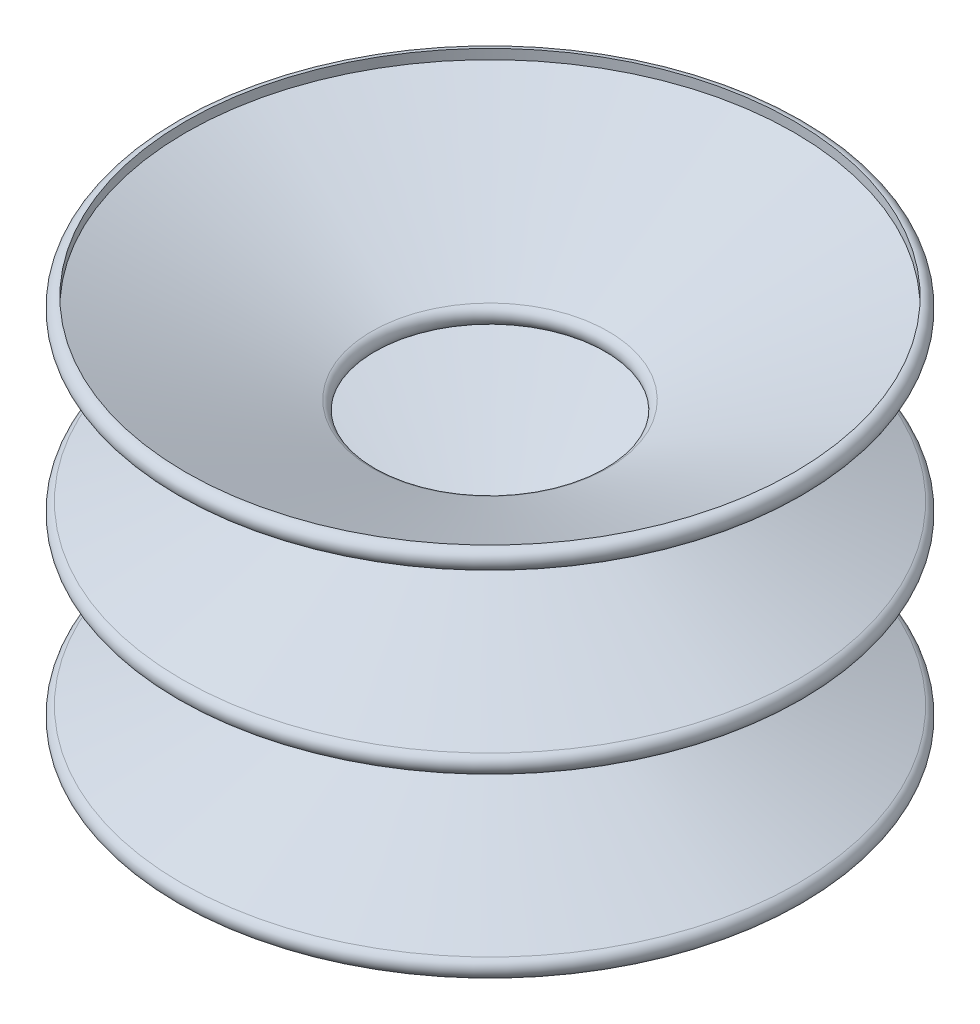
ISO-10303-21;
HEADER;
FILE_DESCRIPTION(('STEP AP214'),'2;1');
FILE_NAME('part.step','',(''),(''),'','','');
FILE_SCHEMA(('AUTOMOTIVE_DESIGN { 1 0 10303 214 1 1 1 1 }'));
ENDSEC;
DATA;
#1=APPLICATION_CONTEXT('core data for automotive mechanical design processes');
#2=APPLICATION_PROTOCOL_DEFINITION('international standard','automotive_design',2000,#1);
#3=PRODUCT_CONTEXT('',#1,'mechanical');
#4=PRODUCT('Part','Part','',(#3));
#5=PRODUCT_RELATED_PRODUCT_CATEGORY('part','',(#4));
#6=PRODUCT_DEFINITION_FORMATION('','',#4);
#7=PRODUCT_DEFINITION_CONTEXT('part definition',#1,'design');
#8=PRODUCT_DEFINITION('design','',#6,#7);
#9=PRODUCT_DEFINITION_SHAPE('','',#8);
#10=(LENGTH_UNIT() NAMED_UNIT(*) SI_UNIT(.MILLI.,.METRE.));
#11=(NAMED_UNIT(*) PLANE_ANGLE_UNIT() SI_UNIT($,.RADIAN.));
#12=(NAMED_UNIT(*) SI_UNIT($,.STERADIAN.) SOLID_ANGLE_UNIT());
#13=UNCERTAINTY_MEASURE_WITH_UNIT(LENGTH_MEASURE(1.E-05),#10,'distance_accuracy_value','');
#14=(GEOMETRIC_REPRESENTATION_CONTEXT(3) GLOBAL_UNCERTAINTY_ASSIGNED_CONTEXT((#13)) GLOBAL_UNIT_ASSIGNED_CONTEXT((#10,
#11,#12)) REPRESENTATION_CONTEXT('',''));
#15=CARTESIAN_POINT('',(0.,0.,0.));
#16=DIRECTION('',(0.,0.,1.));
#17=DIRECTION('',(1.,0.,0.));
#18=AXIS2_PLACEMENT_3D('',#15,#16,#17);
#19=CARTESIAN_POINT('',(0.,90.8709851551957,0.));
#20=DIRECTION('',(0.,1.,0.));
#21=DIRECTION('',(0.,0.,1.));
#22=AXIS2_PLACEMENT_3D('',#19,#20,#21);
#23=CYLINDRICAL_SURFACE('',#22,4.99999999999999);
#24=CARTESIAN_POINT('',(0.,1.,0.));
#25=DIRECTION('',(0.,1.,0.));
#26=DIRECTION('',(0.,0.,1.));
#27=AXIS2_PLACEMENT_3D('',#24,#25,#26);
#28=CIRCLE('',#27,4.99999999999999);
#29=CARTESIAN_POINT('',(0.,1.,4.99999999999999));
#30=VERTEX_POINT('',#29);
#31=EDGE_CURVE('E10',#30,#30,#28,.T.);
#32=ORIENTED_EDGE('',*,*,#31,.T.);
#33=EDGE_LOOP('',(#32));
#34=FACE_BOUND('',#33,.T.);
#35=CARTESIAN_POINT('',(0.,0.,0.));
#36=DIRECTION('',(0.,1.,0.));
#37=DIRECTION('',(0.,0.,1.));
#38=AXIS2_PLACEMENT_3D('',#35,#36,#37);
#39=CIRCLE('',#38,4.99999999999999);
#40=CARTESIAN_POINT('',(0.,0.,4.99999999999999));
#41=VERTEX_POINT('',#40);
#42=EDGE_CURVE('E97',#41,#41,#39,.T.);
#43=ORIENTED_EDGE('',*,*,#42,.F.);
#44=EDGE_LOOP('',(#43));
#45=FACE_BOUND('',#44,.T.);
#46=ADVANCED_FACE('F24',(#34,#45),#23,.F.);
#47=CARTESIAN_POINT('',(-8.99999999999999,1.,0.));
#48=DIRECTION('',(0.,1.,0.));
#49=DIRECTION('',(0.,0.,1.));
#50=AXIS2_PLACEMENT_3D('',#47,#48,#49);
#51=PLANE('',#50);
#52=CARTESIAN_POINT('',(0.,1.,0.));
#53=DIRECTION('',(0.,1.,0.));
#54=DIRECTION('',(0.,0.,1.));
#55=AXIS2_PLACEMENT_3D('',#52,#53,#54);
#56=CIRCLE('',#55,8.99999999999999);
#57=CARTESIAN_POINT('',(0.,1.,8.99999999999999));
#58=VERTEX_POINT('',#57);
#59=EDGE_CURVE('E30',#58,#58,#56,.T.);
#60=ORIENTED_EDGE('',*,*,#59,.T.);
#61=EDGE_LOOP('',(#60));
#62=FACE_BOUND('',#61,.T.);
#63=ORIENTED_EDGE('',*,*,#31,.F.);
#64=EDGE_LOOP('',(#63));
#65=FACE_BOUND('',#64,.T.);
#66=ADVANCED_FACE('F105',(#62,#65),#51,.T.);
#67=CARTESIAN_POINT('',(0.,90.8709851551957,0.));
#68=DIRECTION('',(0.,1.,0.));
#69=DIRECTION('',(0.,0.,1.));
#70=AXIS2_PLACEMENT_3D('',#67,#68,#69);
#71=CYLINDRICAL_SURFACE('',#70,8.99999999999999);
#72=CARTESIAN_POINT('',(0.,4.69,0.));
#73=DIRECTION('',(0.,1.,0.));
#74=DIRECTION('',(0.,0.,1.));
#75=AXIS2_PLACEMENT_3D('',#72,#73,#74);
#76=CIRCLE('',#75,8.99999999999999);
#77=CARTESIAN_POINT('',(0.,4.69,8.99999999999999));
#78=VERTEX_POINT('',#77);
#79=EDGE_CURVE('E34',#78,#78,#76,.T.);
#80=ORIENTED_EDGE('',*,*,#79,.T.);
#81=EDGE_LOOP('',(#80));
#82=FACE_BOUND('',#81,.T.);
#83=ORIENTED_EDGE('',*,*,#59,.F.);
#84=EDGE_LOOP('',(#83));
#85=FACE_BOUND('',#84,.T.);
#86=ADVANCED_FACE('F109',(#82,#85),#71,.F.);
#87=CARTESIAN_POINT('',(0.,4.69,0.));
#88=DIRECTION('',(0.,1.,0.));
#89=DIRECTION('',(0.,0.,1.));
#90=AXIS2_PLACEMENT_3D('',#87,#88,#89);
#91=CONICAL_SURFACE('',#90,8.99999999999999,1.20963676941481);
#92=CARTESIAN_POINT('',(0.,13.,0.));
#93=DIRECTION('',(0.,1.,0.));
#94=DIRECTION('',(0.,0.,1.));
#95=AXIS2_PLACEMENT_3D('',#92,#93,#94);
#96=CIRCLE('',#95,31.);
#97=CARTESIAN_POINT('',(0.,13.,31.));
#98=VERTEX_POINT('',#97);
#99=EDGE_CURVE('E38',#98,#98,#96,.T.);
#100=CARTESIAN_POINT('',(0.,13.,31.));
#101=CARTESIAN_POINT('',(0.,12.9134375,30.7708333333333));
#102=CARTESIAN_POINT('',(0.,12.826875,30.5416666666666));
#103=CARTESIAN_POINT('',(0.,12.65375,30.0833333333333));
#104=CARTESIAN_POINT('',(0.,12.5671875,29.8541666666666));
#105=CARTESIAN_POINT('',(0.,12.3940625,29.3958333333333));
#106=CARTESIAN_POINT('',(0.,12.3075,29.1666666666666));
#107=CARTESIAN_POINT('',(0.,12.134375,28.7083333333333));
#108=CARTESIAN_POINT('',(0.,12.0478125,28.4791666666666));
#109=CARTESIAN_POINT('',(0.,11.8746875,28.0208333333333));
#110=CARTESIAN_POINT('',(0.,11.788125,27.7916666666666));
#111=CARTESIAN_POINT('',(0.,11.615,27.3333333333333));
#112=CARTESIAN_POINT('',(0.,11.5284375,27.1041666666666));
#113=CARTESIAN_POINT('',(0.,11.3553125,26.6458333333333));
#114=CARTESIAN_POINT('',(0.,11.26875,26.4166666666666));
#115=CARTESIAN_POINT('',(0.,11.095625,25.9583333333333));
#116=CARTESIAN_POINT('',(0.,11.0090625,25.7291666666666));
#117=CARTESIAN_POINT('',(0.,10.8359375,25.2708333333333));
#118=CARTESIAN_POINT('',(0.,10.749375,25.0416666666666));
#119=CARTESIAN_POINT('',(0.,10.57625,24.5833333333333));
#120=CARTESIAN_POINT('',(0.,10.4896875,24.3541666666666));
#121=CARTESIAN_POINT('',(0.,10.3165625,23.8958333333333));
#122=CARTESIAN_POINT('',(0.,10.23,23.6666666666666));
#123=CARTESIAN_POINT('',(0.,10.056875,23.2083333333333));
#124=CARTESIAN_POINT('',(0.,9.9703125,22.9791666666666));
#125=CARTESIAN_POINT('',(0.,9.7971875,22.5208333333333));
#126=CARTESIAN_POINT('',(0.,9.710625,22.2916666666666));
#127=CARTESIAN_POINT('',(0.,9.5375,21.8333333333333));
#128=CARTESIAN_POINT('',(0.,9.4509375,21.6041666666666));
#129=CARTESIAN_POINT('',(0.,9.2778125,21.1458333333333));
#130=CARTESIAN_POINT('',(0.,9.19125,20.9166666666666));
#131=CARTESIAN_POINT('',(0.,9.018125,20.4583333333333));
#132=CARTESIAN_POINT('',(0.,8.9315625,20.2291666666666));
#133=CARTESIAN_POINT('',(0.,8.7584375,19.7708333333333));
#134=CARTESIAN_POINT('',(0.,8.671875,19.5416666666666));
#135=CARTESIAN_POINT('',(0.,8.49875,19.0833333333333));
#136=CARTESIAN_POINT('',(0.,8.4121875,18.8541666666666));
#137=CARTESIAN_POINT('',(0.,8.2390625,18.3958333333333));
#138=CARTESIAN_POINT('',(0.,8.1525,18.1666666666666));
#139=CARTESIAN_POINT('',(0.,7.979375,17.7083333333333));
#140=CARTESIAN_POINT('',(0.,7.8928125,17.4791666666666));
#141=CARTESIAN_POINT('',(0.,7.7196875,17.0208333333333));
#142=CARTESIAN_POINT('',(0.,7.633125,16.7916666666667));
#143=CARTESIAN_POINT('',(0.,7.46,16.3333333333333));
#144=CARTESIAN_POINT('',(0.,7.3734375,16.1041666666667));
#145=CARTESIAN_POINT('',(0.,7.2003125,15.6458333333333));
#146=CARTESIAN_POINT('',(0.,7.11375,15.4166666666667));
#147=CARTESIAN_POINT('',(0.,6.940625,14.9583333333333));
#148=CARTESIAN_POINT('',(0.,6.8540625,14.7291666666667));
#149=CARTESIAN_POINT('',(0.,6.6809375,14.2708333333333));
#150=CARTESIAN_POINT('',(0.,6.594375,14.0416666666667));
#151=CARTESIAN_POINT('',(0.,6.42125,13.5833333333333));
#152=CARTESIAN_POINT('',(0.,6.3346875,13.3541666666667));
#153=CARTESIAN_POINT('',(0.,6.1615625,12.8958333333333));
#154=CARTESIAN_POINT('',(0.,6.075,12.6666666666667));
#155=CARTESIAN_POINT('',(0.,5.901875,12.2083333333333));
#156=CARTESIAN_POINT('',(0.,5.8153125,11.9791666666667));
#157=CARTESIAN_POINT('',(0.,5.6421875,11.5208333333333));
#158=CARTESIAN_POINT('',(0.,5.555625,11.2916666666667));
#159=CARTESIAN_POINT('',(0.,5.3825,10.8333333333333));
#160=CARTESIAN_POINT('',(0.,5.2959375,10.6041666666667));
#161=CARTESIAN_POINT('',(0.,5.1228125,10.1458333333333));
#162=CARTESIAN_POINT('',(0.,5.03625,9.91666666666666));
#163=CARTESIAN_POINT('',(0.,4.863125,9.45833333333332));
#164=CARTESIAN_POINT('',(0.,4.7765625,9.22916666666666));
#165=CARTESIAN_POINT('',(0.,4.69,8.99999999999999));
#166=B_SPLINE_CURVE_WITH_KNOTS('',3,(#100,#101,#102,#103,#104,#105,#106,#107,#108,#109,#110,
#111,#112,#113,#114,#115,#116,#117,#118,#119,#120,#121,#122,#123,#124,#125,#126,#127,#128,#129,
#130,#131,#132,#133,#134,#135,#136,#137,#138,#139,#140,#141,#142,#143,#144,#145,#146,#147,#148,
#149,#150,#151,#152,#153,#154,#155,#156,#157,#158,#159,#160,#161,#162,#163,#164,#165),
.UNSPECIFIED.,.F.,.F.,(4,2,2,2,2,2,2,2,2,2,2,2,2,2,2,2,2,2,2,2,2,2,2,2,2,2,2,2,2,2,2,2,4),(0.,
0.73491077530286,1.46982155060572,2.20473232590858,2.93964310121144,3.67455387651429,
4.40946465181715,5.14437542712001,5.87928620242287,6.61419697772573,7.34910775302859,
8.08401852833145,8.81892930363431,9.55384007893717,10.28875085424,11.0236616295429,
11.7585724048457,12.4934831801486,13.2283939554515,13.9633047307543,14.6982155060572,
15.43312628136,16.1680370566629,16.9029478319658,17.6378586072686,18.3727693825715,
19.1076801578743,19.8425909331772,20.5775017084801,21.3124124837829,22.0473232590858,
22.7822340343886,23.5171448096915),.UNSPECIFIED.);
#167=EDGE_CURVE('BSEAM113',#98,#78,#166,.T.);
#168=ORIENTED_EDGE('',*,*,#99,.T.);
#169=ORIENTED_EDGE('',*,*,#79,.F.);
#170=ORIENTED_EDGE('',*,*,#167,.T.);
#171=ORIENTED_EDGE('',*,*,#167,.F.);
#172=EDGE_LOOP('',(#168,#170,#169,#171));
#173=FACE_BOUND('',#172,.T.);
#174=ADVANCED_FACE('F113',(#173),#91,.F.);
#175=CARTESIAN_POINT('',(0.,13.,0.));
#176=DIRECTION('',(0.,-1.,0.));
#177=DIRECTION('',(0.,0.,-1.));
#178=AXIS2_PLACEMENT_3D('',#175,#176,#177);
#179=CONICAL_SURFACE('',#178,31.,1.16759904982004);
#180=CARTESIAN_POINT('',(0.,21.0801887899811,0.));
#181=DIRECTION('',(0.,1.,0.));
#182=DIRECTION('',(0.,0.,1.));
#183=AXIS2_PLACEMENT_3D('',#180,#181,#182);
#184=CIRCLE('',#183,12.0576387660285);
#185=CARTESIAN_POINT('',(0.,21.0801887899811,12.0576387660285));
#186=VERTEX_POINT('',#185);
#187=EDGE_CURVE('E43',#186,#186,#184,.T.);
#188=ORIENTED_EDGE('',*,*,#187,.T.);
#189=EDGE_LOOP('',(#188));
#190=FACE_BOUND('',#189,.T.);
#191=ORIENTED_EDGE('',*,*,#99,.F.);
#192=EDGE_LOOP('',(#191));
#193=FACE_BOUND('',#192,.T.);
#194=ADVANCED_FACE('F120',(#190,#193),#179,.F.);
#195=CARTESIAN_POINT('',(0.,22.,0.));
#196=DIRECTION('',(0.,1.,0.));
#197=DIRECTION('',(0.,0.,1.));
#198=AXIS2_PLACEMENT_3D('',#195,#196,#197);
#199=TOROIDAL_SURFACE('',#198,12.45,0.999999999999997);
#200=CARTESIAN_POINT('',(0.,22.9198112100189,0.));
#201=DIRECTION('',(0.,1.,0.));
#202=DIRECTION('',(0.,0.,1.));
#203=AXIS2_PLACEMENT_3D('',#200,#201,#202);
#204=CIRCLE('',#203,12.0576387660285);
#205=CARTESIAN_POINT('',(0.,22.9198112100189,12.0576387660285));
#206=VERTEX_POINT('',#205);
#207=EDGE_CURVE('E46',#206,#206,#204,.T.);
#208=ORIENTED_EDGE('',*,*,#207,.T.);
#209=EDGE_LOOP('',(#208));
#210=FACE_BOUND('',#209,.T.);
#211=ORIENTED_EDGE('',*,*,#187,.F.);
#212=EDGE_LOOP('',(#211));
#213=FACE_BOUND('',#212,.T.);
#214=ADVANCED_FACE('F124',(#210,#213),#199,.T.);
#215=CARTESIAN_POINT('',(0.,22.9198112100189,0.));
#216=DIRECTION('',(0.,1.,0.));
#217=DIRECTION('',(0.,0.,1.));
#218=AXIS2_PLACEMENT_3D('',#215,#216,#217);
#219=CONICAL_SURFACE('',#218,12.0576387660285,1.16759904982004);
#220=CARTESIAN_POINT('',(0.,31.,0.));
#221=DIRECTION('',(0.,1.,0.));
#222=DIRECTION('',(0.,0.,1.));
#223=AXIS2_PLACEMENT_3D('',#220,#221,#222);
#224=CIRCLE('',#223,31.);
#225=CARTESIAN_POINT('',(0.,31.,31.));
#226=VERTEX_POINT('',#225);
#227=EDGE_CURVE('E49',#226,#226,#224,.T.);
#228=ORIENTED_EDGE('',*,*,#227,.T.);
#229=EDGE_LOOP('',(#228));
#230=FACE_BOUND('',#229,.T.);
#231=ORIENTED_EDGE('',*,*,#207,.F.);
#232=EDGE_LOOP('',(#231));
#233=FACE_BOUND('',#232,.T.);
#234=ADVANCED_FACE('F128',(#230,#233),#219,.F.);
#235=CARTESIAN_POINT('',(0.,31.,0.));
#236=DIRECTION('',(0.,-1.,0.));
#237=DIRECTION('',(0.,0.,-1.));
#238=AXIS2_PLACEMENT_3D('',#235,#236,#237);
#239=CONICAL_SURFACE('',#238,31.,1.16759904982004);
#240=CARTESIAN_POINT('',(0.,39.0801887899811,0.));
#241=DIRECTION('',(0.,1.,0.));
#242=DIRECTION('',(0.,0.,1.));
#243=AXIS2_PLACEMENT_3D('',#240,#241,#242);
#244=CIRCLE('',#243,12.0576387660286);
#245=CARTESIAN_POINT('',(0.,39.0801887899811,12.0576387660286));
#246=VERTEX_POINT('',#245);
#247=EDGE_CURVE('E52',#246,#246,#244,.T.);
#248=ORIENTED_EDGE('',*,*,#247,.T.);
#249=EDGE_LOOP('',(#248));
#250=FACE_BOUND('',#249,.T.);
#251=ORIENTED_EDGE('',*,*,#227,.F.);
#252=EDGE_LOOP('',(#251));
#253=FACE_BOUND('',#252,.T.);
#254=ADVANCED_FACE('F132',(#250,#253),#239,.F.);
#255=CARTESIAN_POINT('',(0.,40.,0.));
#256=DIRECTION('',(0.,1.,0.));
#257=DIRECTION('',(0.,0.,1.));
#258=AXIS2_PLACEMENT_3D('',#255,#256,#257);
#259=TOROIDAL_SURFACE('',#258,12.45,1.00000000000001);
#260=CARTESIAN_POINT('',(0.,40.9198112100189,0.));
#261=DIRECTION('',(0.,1.,0.));
#262=DIRECTION('',(0.,0.,1.));
#263=AXIS2_PLACEMENT_3D('',#260,#261,#262);
#264=CIRCLE('',#263,12.0576387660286);
#265=CARTESIAN_POINT('',(0.,40.9198112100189,12.0576387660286));
#266=VERTEX_POINT('',#265);
#267=EDGE_CURVE('E55',#266,#266,#264,.T.);
#268=ORIENTED_EDGE('',*,*,#267,.T.);
#269=EDGE_LOOP('',(#268));
#270=FACE_BOUND('',#269,.T.);
#271=ORIENTED_EDGE('',*,*,#247,.F.);
#272=EDGE_LOOP('',(#271));
#273=FACE_BOUND('',#272,.T.);
#274=ADVANCED_FACE('F136',(#270,#273),#259,.T.);
#275=CARTESIAN_POINT('',(0.,40.9198112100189,0.));
#276=DIRECTION('',(0.,1.,0.));
#277=DIRECTION('',(0.,0.,1.));
#278=AXIS2_PLACEMENT_3D('',#275,#276,#277);
#279=CONICAL_SURFACE('',#278,12.0576387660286,1.16759904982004);
#280=CARTESIAN_POINT('',(0.,49.,0.));
#281=DIRECTION('',(0.,1.,0.));
#282=DIRECTION('',(0.,0.,1.));
#283=AXIS2_PLACEMENT_3D('',#280,#281,#282);
#284=CIRCLE('',#283,31.);
#285=CARTESIAN_POINT('',(0.,49.,31.));
#286=VERTEX_POINT('',#285);
#287=EDGE_CURVE('E58',#286,#286,#284,.T.);
#288=ORIENTED_EDGE('',*,*,#287,.T.);
#289=EDGE_LOOP('',(#288));
#290=FACE_BOUND('',#289,.T.);
#291=ORIENTED_EDGE('',*,*,#267,.F.);
#292=EDGE_LOOP('',(#291));
#293=FACE_BOUND('',#292,.T.);
#294=ADVANCED_FACE('F140',(#290,#293),#279,.F.);
#295=CARTESIAN_POINT('',(0.,90.8709851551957,0.));
#296=DIRECTION('',(0.,1.,0.));
#297=DIRECTION('',(0.,0.,1.));
#298=AXIS2_PLACEMENT_3D('',#295,#296,#297);
#299=CYLINDRICAL_SURFACE('',#298,31.);
#300=CARTESIAN_POINT('',(0.,50.,0.));
#301=DIRECTION('',(0.,1.,0.));
#302=DIRECTION('',(0.,0.,1.));
#303=AXIS2_PLACEMENT_3D('',#300,#301,#302);
#304=CIRCLE('',#303,31.);
#305=CARTESIAN_POINT('',(0.,50.,31.));
#306=VERTEX_POINT('',#305);
#307=EDGE_CURVE('E61',#306,#306,#304,.T.);
#308=ORIENTED_EDGE('',*,*,#307,.T.);
#309=EDGE_LOOP('',(#308));
#310=FACE_BOUND('',#309,.T.);
#311=ORIENTED_EDGE('',*,*,#287,.F.);
#312=EDGE_LOOP('',(#311));
#313=FACE_BOUND('',#312,.T.);
#314=ADVANCED_FACE('F144',(#310,#313),#299,.F.);
#315=CARTESIAN_POINT('',(0.,49.,0.));
#316=DIRECTION('',(0.,1.,0.));
#317=DIRECTION('',(0.,0.,1.));
#318=AXIS2_PLACEMENT_3D('',#315,#316,#317);
#319=TOROIDAL_SURFACE('',#318,31.,0.999999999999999);
#320=CARTESIAN_POINT('',(0.,48.0801999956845,0.));
#321=DIRECTION('',(0.,1.,0.));
#322=DIRECTION('',(0.,0.,1.));
#323=AXIS2_PLACEMENT_3D('',#320,#321,#322);
#324=CIRCLE('',#323,31.3923875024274);
#325=CARTESIAN_POINT('',(0.,48.0801999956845,31.3923875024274));
#326=VERTEX_POINT('',#325);
#327=EDGE_CURVE('E64',#326,#326,#324,.T.);
#328=ORIENTED_EDGE('',*,*,#327,.T.);
#329=EDGE_LOOP('',(#328));
#330=FACE_BOUND('',#329,.T.);
#331=ORIENTED_EDGE('',*,*,#307,.F.);
#332=EDGE_LOOP('',(#331));
#333=FACE_BOUND('',#332,.T.);
#334=ADVANCED_FACE('F148',(#330,#333),#319,.T.);
#335=CARTESIAN_POINT('',(0.,48.0801999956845,0.));
#336=DIRECTION('',(0.,1.,0.));
#337=DIRECTION('',(0.,0.,1.));
#338=AXIS2_PLACEMENT_3D('',#335,#336,#337);
#339=CONICAL_SURFACE('',#338,31.3923875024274,1.1675704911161);
#340=CARTESIAN_POINT('',(0.,40.9198000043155,0.));
#341=DIRECTION('',(0.,1.,0.));
#342=DIRECTION('',(0.,0.,1.));
#343=AXIS2_PLACEMENT_3D('',#340,#341,#342);
#344=CIRCLE('',#343,14.6076124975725);
#345=CARTESIAN_POINT('',(0.,40.9198000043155,14.6076124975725));
#346=VERTEX_POINT('',#345);
#347=EDGE_CURVE('E67',#346,#346,#344,.T.);
#348=ORIENTED_EDGE('',*,*,#347,.T.);
#349=EDGE_LOOP('',(#348));
#350=FACE_BOUND('',#349,.T.);
#351=ORIENTED_EDGE('',*,*,#327,.F.);
#352=EDGE_LOOP('',(#351));
#353=FACE_BOUND('',#352,.T.);
#354=ADVANCED_FACE('F152',(#350,#353),#339,.T.);
#355=CARTESIAN_POINT('',(0.,40.,0.));
#356=DIRECTION('',(0.,1.,0.));
#357=DIRECTION('',(0.,0.,1.));
#358=AXIS2_PLACEMENT_3D('',#355,#356,#357);
#359=TOROIDAL_SURFACE('',#358,15.,1.);
#360=CARTESIAN_POINT('',(0.,39.0801999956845,0.));
#361=DIRECTION('',(0.,1.,0.));
#362=DIRECTION('',(0.,0.,1.));
#363=AXIS2_PLACEMENT_3D('',#360,#361,#362);
#364=CIRCLE('',#363,14.6076124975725);
#365=CARTESIAN_POINT('',(0.,39.0801999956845,14.6076124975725));
#366=VERTEX_POINT('',#365);
#367=EDGE_CURVE('E70',#366,#366,#364,.T.);
#368=ORIENTED_EDGE('',*,*,#367,.T.);
#369=EDGE_LOOP('',(#368));
#370=FACE_BOUND('',#369,.T.);
#371=ORIENTED_EDGE('',*,*,#347,.F.);
#372=EDGE_LOOP('',(#371));
#373=FACE_BOUND('',#372,.T.);
#374=ADVANCED_FACE('F156',(#370,#373),#359,.F.);
#375=CARTESIAN_POINT('',(0.,39.0801999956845,0.));
#376=DIRECTION('',(0.,-1.,0.));
#377=DIRECTION('',(0.,0.,-1.));
#378=AXIS2_PLACEMENT_3D('',#375,#376,#377);
#379=CONICAL_SURFACE('',#378,14.6076124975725,1.1675704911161);
#380=CARTESIAN_POINT('',(0.,31.9198000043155,0.));
#381=DIRECTION('',(0.,1.,0.));
#382=DIRECTION('',(0.,0.,1.));
#383=AXIS2_PLACEMENT_3D('',#380,#381,#382);
#384=CIRCLE('',#383,31.3923875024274);
#385=CARTESIAN_POINT('',(0.,31.9198000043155,31.3923875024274));
#386=VERTEX_POINT('',#385);
#387=EDGE_CURVE('E73',#386,#386,#384,.T.);
#388=ORIENTED_EDGE('',*,*,#387,.T.);
#389=EDGE_LOOP('',(#388));
#390=FACE_BOUND('',#389,.T.);
#391=ORIENTED_EDGE('',*,*,#367,.F.);
#392=EDGE_LOOP('',(#391));
#393=FACE_BOUND('',#392,.T.);
#394=ADVANCED_FACE('F160',(#390,#393),#379,.T.);
#395=CARTESIAN_POINT('',(0.,31.,0.));
#396=DIRECTION('',(0.,1.,0.));
#397=DIRECTION('',(0.,0.,1.));
#398=AXIS2_PLACEMENT_3D('',#395,#396,#397);
#399=TOROIDAL_SURFACE('',#398,31.,1.);
#400=CARTESIAN_POINT('',(0.,30.0801887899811,0.));
#401=DIRECTION('',(0.,1.,0.));
#402=DIRECTION('',(0.,0.,1.));
#403=AXIS2_PLACEMENT_3D('',#400,#401,#402);
#404=CIRCLE('',#403,31.3923612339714);
#405=CARTESIAN_POINT('',(0.,30.0801887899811,31.3923612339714));
#406=VERTEX_POINT('',#405);
#407=EDGE_CURVE('E76',#406,#406,#404,.T.);
#408=ORIENTED_EDGE('',*,*,#407,.T.);
#409=EDGE_LOOP('',(#408));
#410=FACE_BOUND('',#409,.T.);
#411=ORIENTED_EDGE('',*,*,#387,.F.);
#412=EDGE_LOOP('',(#411));
#413=FACE_BOUND('',#412,.T.);
#414=ADVANCED_FACE('F164',(#410,#413),#399,.T.);
#415=CARTESIAN_POINT('',(0.,30.0801887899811,0.));
#416=DIRECTION('',(0.,1.,0.));
#417=DIRECTION('',(0.,0.,1.));
#418=AXIS2_PLACEMENT_3D('',#415,#416,#417);
#419=CONICAL_SURFACE('',#418,31.3923612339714,1.16759904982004);
#420=CARTESIAN_POINT('',(0.,22.9202905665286,0.));
#421=DIRECTION('',(0.,1.,0.));
#422=DIRECTION('',(0.,0.,1.));
#423=AXIS2_PLACEMENT_3D('',#420,#421,#422);
#424=CIRCLE('',#423,14.6074342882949);
#425=CARTESIAN_POINT('',(0.,22.9202905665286,14.6074342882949));
#426=VERTEX_POINT('',#425);
#427=EDGE_CURVE('E79',#426,#426,#424,.T.);
#428=ORIENTED_EDGE('',*,*,#427,.T.);
#429=EDGE_LOOP('',(#428));
#430=FACE_BOUND('',#429,.T.);
#431=ORIENTED_EDGE('',*,*,#407,.F.);
#432=EDGE_LOOP('',(#431));
#433=FACE_BOUND('',#432,.T.);
#434=ADVANCED_FACE('F168',(#430,#433),#419,.T.);
#435=CARTESIAN_POINT('',(0.,22.,0.));
#436=DIRECTION('',(0.,1.,0.));
#437=DIRECTION('',(0.,0.,1.));
#438=AXIS2_PLACEMENT_3D('',#435,#436,#437);
#439=TOROIDAL_SURFACE('',#438,15.,1.00052114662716);
#440=CARTESIAN_POINT('',(0.,21.0797094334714,0.));
#441=DIRECTION('',(0.,1.,0.));
#442=DIRECTION('',(0.,0.,1.));
#443=AXIS2_PLACEMENT_3D('',#440,#441,#442);
#444=CIRCLE('',#443,14.6074342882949);
#445=CARTESIAN_POINT('',(0.,21.0797094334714,14.6074342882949));
#446=VERTEX_POINT('',#445);
#447=EDGE_CURVE('E82',#446,#446,#444,.T.);
#448=ORIENTED_EDGE('',*,*,#447,.T.);
#449=EDGE_LOOP('',(#448));
#450=FACE_BOUND('',#449,.T.);
#451=ORIENTED_EDGE('',*,*,#427,.F.);
#452=EDGE_LOOP('',(#451));
#453=FACE_BOUND('',#452,.T.);
#454=ADVANCED_FACE('F172',(#450,#453),#439,.F.);
#455=CARTESIAN_POINT('',(0.,21.0797094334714,0.));
#456=DIRECTION('',(0.,-1.,0.));
#457=DIRECTION('',(0.,0.,-1.));
#458=AXIS2_PLACEMENT_3D('',#455,#456,#457);
#459=CONICAL_SURFACE('',#458,14.6074342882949,1.16759904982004);
#460=CARTESIAN_POINT('',(0.,13.9198112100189,0.));
#461=DIRECTION('',(0.,1.,0.));
#462=DIRECTION('',(0.,0.,1.));
#463=AXIS2_PLACEMENT_3D('',#460,#461,#462);
#464=CIRCLE('',#463,31.3923612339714);
#465=CARTESIAN_POINT('',(0.,13.9198112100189,31.3923612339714));
#466=VERTEX_POINT('',#465);
#467=EDGE_CURVE('E85',#466,#466,#464,.T.);
#468=ORIENTED_EDGE('',*,*,#467,.T.);
#469=EDGE_LOOP('',(#468));
#470=FACE_BOUND('',#469,.T.);
#471=ORIENTED_EDGE('',*,*,#447,.F.);
#472=EDGE_LOOP('',(#471));
#473=FACE_BOUND('',#472,.T.);
#474=ADVANCED_FACE('F176',(#470,#473),#459,.T.);
#475=CARTESIAN_POINT('',(0.,13.,0.));
#476=DIRECTION('',(0.,1.,0.));
#477=DIRECTION('',(0.,0.,1.));
#478=AXIS2_PLACEMENT_3D('',#475,#476,#477);
#479=TOROIDAL_SURFACE('',#478,31.,0.999999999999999);
#480=CARTESIAN_POINT('',(0.,12.0644944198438,0.));
#481=DIRECTION('',(0.,1.,0.));
#482=DIRECTION('',(0.,0.,1.));
#483=AXIS2_PLACEMENT_3D('',#480,#481,#482);
#484=CIRCLE('',#483,31.353311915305);
#485=CARTESIAN_POINT('',(0.,12.0644944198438,31.353311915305));
#486=VERTEX_POINT('',#485);
#487=EDGE_CURVE('E88',#486,#486,#484,.T.);
#488=ORIENTED_EDGE('',*,*,#487,.T.);
#489=EDGE_LOOP('',(#488));
#490=FACE_BOUND('',#489,.T.);
#491=ORIENTED_EDGE('',*,*,#467,.F.);
#492=EDGE_LOOP('',(#491));
#493=FACE_BOUND('',#492,.T.);
#494=ADVANCED_FACE('F180',(#490,#493),#479,.T.);
#495=CARTESIAN_POINT('',(0.,12.0644944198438,0.));
#496=DIRECTION('',(0.,1.,0.));
#497=DIRECTION('',(0.,0.,1.));
#498=AXIS2_PLACEMENT_3D('',#495,#496,#497);
#499=CONICAL_SURFACE('',#498,31.353311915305,1.20968733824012);
#500=CARTESIAN_POINT('',(0.,4.,0.));
#501=DIRECTION('',(0.,1.,0.));
#502=DIRECTION('',(0.,0.,1.));
#503=AXIS2_PLACEMENT_3D('',#500,#501,#502);
#504=CIRCLE('',#503,9.99999999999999);
#505=CARTESIAN_POINT('',(0.,4.,9.99999999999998));
#506=VERTEX_POINT('',#505);
#507=EDGE_CURVE('E91',#506,#506,#504,.T.);
#508=CARTESIAN_POINT('',(0.,4.,9.99999999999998));
#509=CARTESIAN_POINT('',(0.,4.08400515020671,10.2224303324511));
#510=CARTESIAN_POINT('',(0.,4.16801030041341,10.4448606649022));
#511=CARTESIAN_POINT('',(0.,4.33602060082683,10.8897213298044));
#512=CARTESIAN_POINT('',(0.,4.42002575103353,11.1121516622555));
#513=CARTESIAN_POINT('',(0.,4.58803605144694,11.5570123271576));
#514=CARTESIAN_POINT('',(0.,4.67204120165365,11.7794426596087));
#515=CARTESIAN_POINT('',(0.,4.84005150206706,12.2243033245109));
#516=CARTESIAN_POINT('',(0.,4.92405665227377,12.446733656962));
#517=CARTESIAN_POINT('',(0.,5.09206695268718,12.8915943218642));
#518=CARTESIAN_POINT('',(0.,5.17607210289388,13.1140246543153));
#519=CARTESIAN_POINT('',(0.,5.34408240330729,13.5588853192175));
#520=CARTESIAN_POINT('',(0.,5.428087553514,13.7813156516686));
#521=CARTESIAN_POINT('',(0.,5.59609785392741,14.2261763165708));
#522=CARTESIAN_POINT('',(0.,5.68010300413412,14.4486066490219));
#523=CARTESIAN_POINT('',(0.,5.84811330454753,14.8934673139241));
#524=CARTESIAN_POINT('',(0.,5.93211845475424,15.1158976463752));
#525=CARTESIAN_POINT('',(0.,6.10012875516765,15.5607583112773));
#526=CARTESIAN_POINT('',(0.,6.18413390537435,15.7831886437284));
#527=CARTESIAN_POINT('',(0.,6.35214420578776,16.2280493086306));
#528=CARTESIAN_POINT('',(0.,6.43614935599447,16.4504796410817));
#529=CARTESIAN_POINT('',(0.,6.60415965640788,16.8953403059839));
#530=CARTESIAN_POINT('',(0.,6.68816480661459,17.117770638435));
#531=CARTESIAN_POINT('',(0.,6.856175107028,17.5626313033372));
#532=CARTESIAN_POINT('',(0.,6.9401802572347,17.7850616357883));
#533=CARTESIAN_POINT('',(0.,7.10819055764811,18.2299223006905));
#534=CARTESIAN_POINT('',(0.,7.19219570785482,18.4523526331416));
#535=CARTESIAN_POINT('',(0.,7.36020600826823,18.8972132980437));
#536=CARTESIAN_POINT('',(0.,7.44421115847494,19.1196436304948));
#537=CARTESIAN_POINT('',(0.,7.61222145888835,19.564504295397));
#538=CARTESIAN_POINT('',(0.,7.69622660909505,19.7869346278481));
#539=CARTESIAN_POINT('',(0.,7.86423690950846,20.2317952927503));
#540=CARTESIAN_POINT('',(0.,7.94824205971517,20.4542256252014));
#541=CARTESIAN_POINT('',(0.,8.11625236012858,20.8990862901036));
#542=CARTESIAN_POINT('',(0.,8.20025751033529,21.1215166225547));
#543=CARTESIAN_POINT('',(0.,8.3682678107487,21.5663772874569));
#544=CARTESIAN_POINT('',(0.,8.45227296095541,21.788807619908));
#545=CARTESIAN_POINT('',(0.,8.62028326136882,22.2336682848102));
#546=CARTESIAN_POINT('',(0.,8.70428841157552,22.4560986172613));
#547=CARTESIAN_POINT('',(0.,8.87229871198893,22.9009592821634));
#548=CARTESIAN_POINT('',(0.,8.95630386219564,23.1233896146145));
#549=CARTESIAN_POINT('',(0.,9.12431416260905,23.5682502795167));
#550=CARTESIAN_POINT('',(0.,9.20831931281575,23.7906806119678));
#551=CARTESIAN_POINT('',(0.,9.37632961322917,24.23554127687));
#552=CARTESIAN_POINT('',(0.,9.46033476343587,24.4579716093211));
#553=CARTESIAN_POINT('',(0.,9.62834506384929,24.9028322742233));
#554=CARTESIAN_POINT('',(0.,9.71235021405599,25.1252626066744));
#555=CARTESIAN_POINT('',(0.,9.8803605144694,25.5701232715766));
#556=CARTESIAN_POINT('',(0.,9.96436566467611,25.7925536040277));
#557=CARTESIAN_POINT('',(0.,10.1323759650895,26.2374142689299));
#558=CARTESIAN_POINT('',(0.,10.2163811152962,26.459844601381));
#559=CARTESIAN_POINT('',(0.,10.3843914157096,26.9047052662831));
#560=CARTESIAN_POINT('',(0.,10.4683965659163,27.1271355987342));
#561=CARTESIAN_POINT('',(0.,10.6364068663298,27.5719962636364));
#562=CARTESIAN_POINT('',(0.,10.7204120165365,27.7944265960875));
#563=CARTESIAN_POINT('',(0.,10.8884223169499,28.2392872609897));
#564=CARTESIAN_POINT('',(0.,10.9724274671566,28.4617175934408));
#565=CARTESIAN_POINT('',(0.,11.14043776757,28.906578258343));
#566=CARTESIAN_POINT('',(0.,11.2244429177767,29.1290085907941));
#567=CARTESIAN_POINT('',(0.,11.3924532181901,29.5738692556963));
#568=CARTESIAN_POINT('',(0.,11.4764583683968,29.7962995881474));
#569=CARTESIAN_POINT('',(0.,11.6444686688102,30.2411602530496));
#570=CARTESIAN_POINT('',(0.,11.7284738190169,30.4635905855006));
#571=CARTESIAN_POINT('',(0.,11.8964841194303,30.9084512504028));
#572=CARTESIAN_POINT('',(0.,11.980489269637,31.1308815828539));
#573=CARTESIAN_POINT('',(0.,12.0644944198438,31.353311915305));
#574=B_SPLINE_CURVE_WITH_KNOTS('',3,(#508,#509,#510,#511,#512,#513,#514,#515,#516,#517,#518,
#519,#520,#521,#522,#523,#524,#525,#526,#527,#528,#529,#530,#531,#532,#533,#534,#535,#536,#537,
#538,#539,#540,#541,#542,#543,#544,#545,#546,#547,#548,#549,#550,#551,#552,#553,#554,#555,#556,
#557,#558,#559,#560,#561,#562,#563,#564,#565,#566,#567,#568,#569,#570,#571,#572,#573),
.UNSPECIFIED.,.F.,.F.,(4,2,2,2,2,2,2,2,2,2,2,2,2,2,2,2,2,2,2,2,2,2,2,2,2,2,2,2,2,2,2,2,4),(0.,
0.713294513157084,1.42658902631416,2.13988353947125,2.85317805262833,3.56647256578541,
4.27976707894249,4.99306159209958,5.70635610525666,6.41965061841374,7.13294513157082,
7.84623964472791,8.55953415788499,9.27282867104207,9.98612318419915,10.6994176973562,
11.4127122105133,12.1260067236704,12.8393012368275,13.5525957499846,14.2658902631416,
14.9791847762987,15.6924792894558,16.4057738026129,17.11906831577,17.8323628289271,
18.5456573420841,19.2589518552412,19.9722463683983,20.6855408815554,21.3988353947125,
22.1121299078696,22.8254244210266),.UNSPECIFIED.);
#575=EDGE_CURVE('BSEAM184',#506,#486,#574,.T.);
#576=ORIENTED_EDGE('',*,*,#507,.T.);
#577=ORIENTED_EDGE('',*,*,#487,.F.);
#578=ORIENTED_EDGE('',*,*,#575,.T.);
#579=ORIENTED_EDGE('',*,*,#575,.F.);
#580=EDGE_LOOP('',(#576,#578,#577,#579));
#581=FACE_BOUND('',#580,.T.);
#582=ADVANCED_FACE('F184',(#581),#499,.T.);
#583=CARTESIAN_POINT('',(0.,90.8709851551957,0.));
#584=DIRECTION('',(0.,1.,0.));
#585=DIRECTION('',(0.,0.,1.));
#586=AXIS2_PLACEMENT_3D('',#583,#584,#585);
#587=CYLINDRICAL_SURFACE('',#586,9.99999999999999);
#588=CARTESIAN_POINT('',(0.,0.,0.));
#589=DIRECTION('',(0.,1.,0.));
#590=DIRECTION('',(0.,0.,1.));
#591=AXIS2_PLACEMENT_3D('',#588,#589,#590);
#592=CIRCLE('',#591,9.99999999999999);
#593=CARTESIAN_POINT('',(0.,0.,9.99999999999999));
#594=VERTEX_POINT('',#593);
#595=EDGE_CURVE('E94',#594,#594,#592,.T.);
#596=ORIENTED_EDGE('',*,*,#595,.T.);
#597=EDGE_LOOP('',(#596));
#598=FACE_BOUND('',#597,.T.);
#599=ORIENTED_EDGE('',*,*,#507,.F.);
#600=EDGE_LOOP('',(#599));
#601=FACE_BOUND('',#600,.T.);
#602=ADVANCED_FACE('F188',(#598,#601),#587,.T.);
#603=CARTESIAN_POINT('',(-4.99999999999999,0.,0.));
#604=DIRECTION('',(0.,-1.,0.));
#605=DIRECTION('',(0.,0.,-1.));
#606=AXIS2_PLACEMENT_3D('',#603,#604,#605);
#607=PLANE('',#606);
#608=ORIENTED_EDGE('',*,*,#42,.T.);
#609=EDGE_LOOP('',(#608));
#610=FACE_BOUND('',#609,.T.);
#611=ORIENTED_EDGE('',*,*,#595,.F.);
#612=EDGE_LOOP('',(#611));
#613=FACE_BOUND('',#612,.T.);
#614=ADVANCED_FACE('F101',(#610,#613),#607,.T.);
#615=CLOSED_SHELL('',(#46,#66,#86,#174,#194,#214,#234,#254,#274,#294,#314,#334,#354,#374,#394,
#414,#434,#454,#474,#494,#582,#602,#614));
#616=MANIFOLD_SOLID_BREP('B2',#615);
#617=ADVANCED_BREP_SHAPE_REPRESENTATION('',(#18,#616),#14);
#618=SHAPE_DEFINITION_REPRESENTATION(#9,#617);
ENDSEC;
END-ISO-10303-21;
